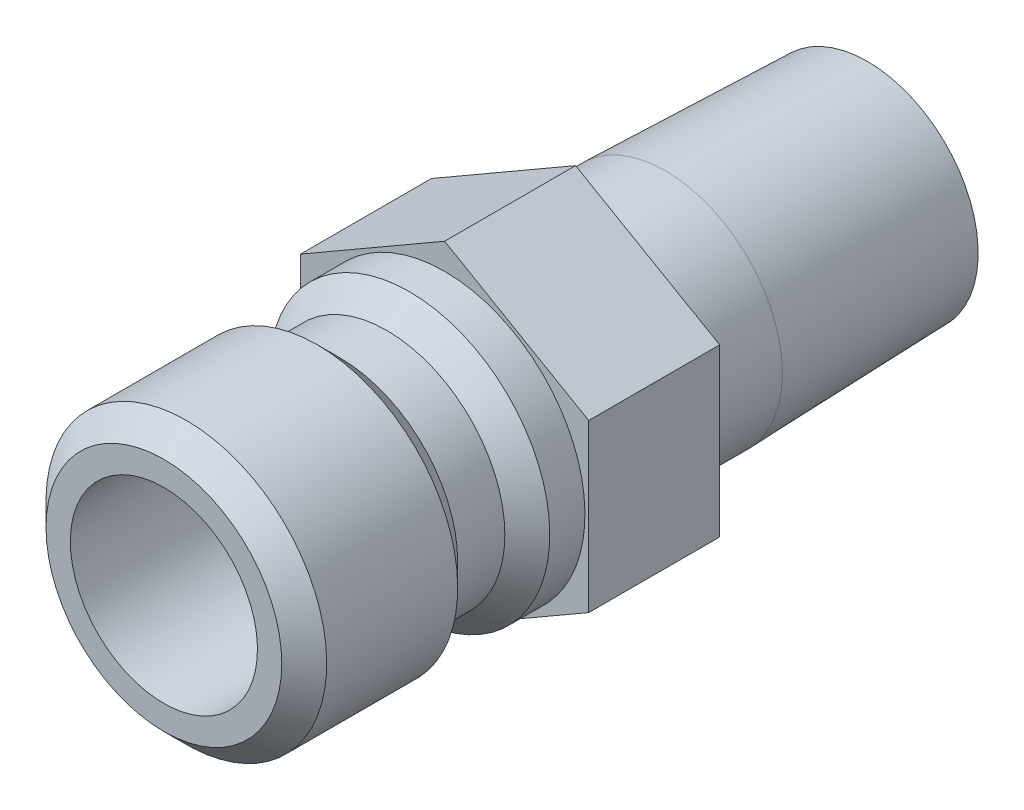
ISO-10303-21;
HEADER;
FILE_DESCRIPTION(('STEP AP214'),'2;1');
FILE_NAME('part.step','',(''),(''),'','','');
FILE_SCHEMA(('AUTOMOTIVE_DESIGN { 1 0 10303 214 1 1 1 1 }'));
ENDSEC;
DATA;
#1=APPLICATION_CONTEXT('core data for automotive mechanical design processes');
#2=APPLICATION_PROTOCOL_DEFINITION('international standard','automotive_design',2000,#1);
#3=PRODUCT_CONTEXT('',#1,'mechanical');
#4=PRODUCT('Part','Part','',(#3));
#5=PRODUCT_RELATED_PRODUCT_CATEGORY('part','',(#4));
#6=PRODUCT_DEFINITION_FORMATION('','',#4);
#7=PRODUCT_DEFINITION_CONTEXT('part definition',#1,'design');
#8=PRODUCT_DEFINITION('design','',#6,#7);
#9=PRODUCT_DEFINITION_SHAPE('','',#8);
#10=(LENGTH_UNIT() NAMED_UNIT(*) SI_UNIT(.MILLI.,.METRE.));
#11=(NAMED_UNIT(*) PLANE_ANGLE_UNIT() SI_UNIT($,.RADIAN.));
#12=(NAMED_UNIT(*) SI_UNIT($,.STERADIAN.) SOLID_ANGLE_UNIT());
#13=UNCERTAINTY_MEASURE_WITH_UNIT(LENGTH_MEASURE(1.E-05),#10,'distance_accuracy_value','');
#14=(GEOMETRIC_REPRESENTATION_CONTEXT(3) GLOBAL_UNCERTAINTY_ASSIGNED_CONTEXT((#13)) GLOBAL_UNIT_ASSIGNED_CONTEXT((#10,
#11,#12)) REPRESENTATION_CONTEXT('',''));
#15=CARTESIAN_POINT('',(0.,0.,0.));
#16=DIRECTION('',(0.,0.,1.));
#17=DIRECTION('',(1.,0.,0.));
#18=AXIS2_PLACEMENT_3D('',#15,#16,#17);
#19=CARTESIAN_POINT('',(0.,0.,0.));
#20=DIRECTION('',(0.,0.,-1.));
#21=DIRECTION('',(0.,1.,0.));
#22=AXIS2_PLACEMENT_3D('',#19,#20,#21);
#23=CYLINDRICAL_SURFACE('',#22,3.96875);
#24=CARTESIAN_POINT('',(0.,0.,-7.493));
#25=DIRECTION('',(0.,0.,-1.));
#26=DIRECTION('',(0.,1.,0.));
#27=AXIS2_PLACEMENT_3D('',#24,#25,#26);
#28=CIRCLE('',#27,3.96875);
#29=CARTESIAN_POINT('',(0.,3.96875,-7.493));
#30=VERTEX_POINT('',#29);
#31=EDGE_CURVE('E155',#30,#30,#28,.T.);
#32=ORIENTED_EDGE('',*,*,#31,.F.);
#33=EDGE_LOOP('',(#32));
#34=FACE_BOUND('',#33,.T.);
#35=CARTESIAN_POINT('',(0.,0.,-4.445));
#36=DIRECTION('',(0.,0.,1.));
#37=DIRECTION('',(1.,0.,0.));
#38=AXIS2_PLACEMENT_3D('',#35,#36,#37);
#39=CIRCLE('',#38,3.96875);
#40=CARTESIAN_POINT('',(3.96875,0.,-4.445));
#41=VERTEX_POINT('',#40);
#42=EDGE_CURVE('E36',#41,#41,#39,.F.);
#43=ORIENTED_EDGE('',*,*,#42,.T.);
#44=EDGE_LOOP('',(#43));
#45=FACE_BOUND('',#44,.T.);
#46=ADVANCED_FACE('F32',(#34,#45),#23,.T.);
#47=CARTESIAN_POINT('',(0.,0.,0.));
#48=DIRECTION('',(0.,0.,-1.));
#49=DIRECTION('',(0.,1.,0.));
#50=AXIS2_PLACEMENT_3D('',#47,#48,#49);
#51=CYLINDRICAL_SURFACE('',#50,3.175);
#52=CARTESIAN_POINT('',(0.,0.,9.525));
#53=DIRECTION('',(0.,0.,-1.));
#54=DIRECTION('',(0.,1.,0.));
#55=AXIS2_PLACEMENT_3D('',#52,#53,#54);
#56=CIRCLE('',#55,3.175);
#57=CARTESIAN_POINT('',(0.,3.175,9.525));
#58=VERTEX_POINT('',#57);
#59=EDGE_CURVE('E11',#58,#58,#56,.T.);
#60=ORIENTED_EDGE('',*,*,#59,.F.);
#61=EDGE_LOOP('',(#60));
#62=FACE_BOUND('',#61,.T.);
#63=CARTESIAN_POINT('',(0.,0.,-0.126999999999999));
#64=DIRECTION('',(0.,0.,-1.));
#65=DIRECTION('',(0.,1.,0.));
#66=AXIS2_PLACEMENT_3D('',#63,#64,#65);
#67=CIRCLE('',#66,3.175);
#68=CARTESIAN_POINT('',(0.,3.175,-0.126999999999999));
#69=VERTEX_POINT('',#68);
#70=EDGE_CURVE('E143',#69,#69,#67,.T.);
#71=ORIENTED_EDGE('',*,*,#70,.T.);
#72=EDGE_LOOP('',(#71));
#73=FACE_BOUND('',#72,.T.);
#74=ADVANCED_FACE('F34',(#62,#73),#51,.F.);
#75=CARTESIAN_POINT('',(0.,3.175,9.525));
#76=DIRECTION('',(0.,0.,1.));
#77=DIRECTION('',(0.,-1.,0.));
#78=AXIS2_PLACEMENT_3D('',#75,#76,#77);
#79=PLANE('',#78);
#80=ORIENTED_EDGE('',*,*,#59,.T.);
#81=EDGE_LOOP('',(#80));
#82=FACE_BOUND('',#81,.T.);
#83=CARTESIAN_POINT('',(0.,0.,9.525));
#84=DIRECTION('',(0.,0.,-1.));
#85=DIRECTION('',(0.,1.,0.));
#86=AXIS2_PLACEMENT_3D('',#83,#84,#85);
#87=CIRCLE('',#86,4.0005);
#88=CARTESIAN_POINT('',(0.,4.0005,9.525));
#89=VERTEX_POINT('',#88);
#90=EDGE_CURVE('E42',#89,#89,#87,.T.);
#91=ORIENTED_EDGE('',*,*,#90,.F.);
#92=EDGE_LOOP('',(#91));
#93=FACE_BOUND('',#92,.T.);
#94=ADVANCED_FACE('F182',(#82,#93),#79,.T.);
#95=CARTESIAN_POINT('',(0.,0.,8.763));
#96=DIRECTION('',(0.,0.,-1.));
#97=DIRECTION('',(0.,1.,0.));
#98=AXIS2_PLACEMENT_3D('',#95,#96,#97);
#99=CONICAL_SURFACE('',#98,4.7625,0.785398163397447);
#100=ORIENTED_EDGE('',*,*,#90,.T.);
#101=EDGE_LOOP('',(#100));
#102=FACE_BOUND('',#101,.T.);
#103=CARTESIAN_POINT('',(0.,0.,8.763));
#104=DIRECTION('',(0.,0.,-1.));
#105=DIRECTION('',(0.,1.,0.));
#106=AXIS2_PLACEMENT_3D('',#103,#104,#105);
#107=CIRCLE('',#106,4.7625);
#108=CARTESIAN_POINT('',(0.,4.7625,8.763));
#109=VERTEX_POINT('',#108);
#110=EDGE_CURVE('E173',#109,#109,#107,.T.);
#111=ORIENTED_EDGE('',*,*,#110,.F.);
#112=EDGE_LOOP('',(#111));
#113=FACE_BOUND('',#112,.T.);
#114=ADVANCED_FACE('F179',(#102,#113),#99,.T.);
#115=CARTESIAN_POINT('',(0.,0.,0.));
#116=DIRECTION('',(0.,0.,-1.));
#117=DIRECTION('',(0.,1.,0.));
#118=AXIS2_PLACEMENT_3D('',#115,#116,#117);
#119=CYLINDRICAL_SURFACE('',#118,4.7625);
#120=ORIENTED_EDGE('',*,*,#110,.T.);
#121=EDGE_LOOP('',(#120));
#122=FACE_BOUND('',#121,.T.);
#123=CARTESIAN_POINT('',(0.,0.,4.318));
#124=DIRECTION('',(0.,0.,-1.));
#125=DIRECTION('',(0.,1.,0.));
#126=AXIS2_PLACEMENT_3D('',#123,#124,#125);
#127=CIRCLE('',#126,4.7625);
#128=CARTESIAN_POINT('',(0.,4.7625,4.318));
#129=VERTEX_POINT('',#128);
#130=EDGE_CURVE('E170',#129,#129,#127,.T.);
#131=ORIENTED_EDGE('',*,*,#130,.F.);
#132=EDGE_LOOP('',(#131));
#133=FACE_BOUND('',#132,.T.);
#134=ADVANCED_FACE('F189',(#122,#133),#119,.T.);
#135=CARTESIAN_POINT('',(0.,0.,3.556));
#136=DIRECTION('',(0.,0.,1.));
#137=DIRECTION('',(0.,-1.,0.));
#138=AXIS2_PLACEMENT_3D('',#135,#136,#137);
#139=CONICAL_SURFACE('',#138,4.0005,0.785398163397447);
#140=ORIENTED_EDGE('',*,*,#130,.T.);
#141=EDGE_LOOP('',(#140));
#142=FACE_BOUND('',#141,.T.);
#143=CARTESIAN_POINT('',(0.,0.,3.556));
#144=DIRECTION('',(0.,0.,-1.));
#145=DIRECTION('',(0.,1.,0.));
#146=AXIS2_PLACEMENT_3D('',#143,#144,#145);
#147=CIRCLE('',#146,4.0005);
#148=CARTESIAN_POINT('',(0.,4.0005,3.556));
#149=VERTEX_POINT('',#148);
#150=EDGE_CURVE('E167',#149,#149,#147,.T.);
#151=ORIENTED_EDGE('',*,*,#150,.F.);
#152=EDGE_LOOP('',(#151));
#153=FACE_BOUND('',#152,.T.);
#154=ADVANCED_FACE('F214',(#142,#153),#139,.T.);
#155=CARTESIAN_POINT('',(0.,0.,0.));
#156=DIRECTION('',(0.,0.,-1.));
#157=DIRECTION('',(0.,1.,0.));
#158=AXIS2_PLACEMENT_3D('',#155,#156,#157);
#159=CYLINDRICAL_SURFACE('',#158,4.0005);
#160=ORIENTED_EDGE('',*,*,#150,.T.);
#161=EDGE_LOOP('',(#160));
#162=FACE_BOUND('',#161,.T.);
#163=CARTESIAN_POINT('',(0.,0.,1.9558));
#164=DIRECTION('',(0.,0.,-1.));
#165=DIRECTION('',(0.,1.,0.));
#166=AXIS2_PLACEMENT_3D('',#163,#164,#165);
#167=CIRCLE('',#166,4.0005);
#168=CARTESIAN_POINT('',(0.,4.0005,1.9558));
#169=VERTEX_POINT('',#168);
#170=EDGE_CURVE('E164',#169,#169,#167,.T.);
#171=ORIENTED_EDGE('',*,*,#170,.F.);
#172=EDGE_LOOP('',(#171));
#173=FACE_BOUND('',#172,.T.);
#174=ADVANCED_FACE('F210',(#162,#173),#159,.T.);
#175=CARTESIAN_POINT('',(0.,0.,1.1938));
#176=DIRECTION('',(0.,0.,-1.));
#177=DIRECTION('',(0.,1.,0.));
#178=AXIS2_PLACEMENT_3D('',#175,#176,#177);
#179=CONICAL_SURFACE('',#178,4.7625,0.785398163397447);
#180=ORIENTED_EDGE('',*,*,#170,.T.);
#181=EDGE_LOOP('',(#180));
#182=FACE_BOUND('',#181,.T.);
#183=CARTESIAN_POINT('',(0.,0.,1.1938));
#184=DIRECTION('',(0.,0.,-1.));
#185=DIRECTION('',(0.,1.,0.));
#186=AXIS2_PLACEMENT_3D('',#183,#184,#185);
#187=CIRCLE('',#186,4.7625);
#188=CARTESIAN_POINT('',(0.,4.7625,1.1938));
#189=VERTEX_POINT('',#188);
#190=EDGE_CURVE('E161',#189,#189,#187,.T.);
#191=ORIENTED_EDGE('',*,*,#190,.F.);
#192=EDGE_LOOP('',(#191));
#193=FACE_BOUND('',#192,.T.);
#194=ADVANCED_FACE('F206',(#182,#193),#179,.T.);
#195=CARTESIAN_POINT('',(0.,0.,0.));
#196=DIRECTION('',(0.,0.,-1.));
#197=DIRECTION('',(0.,1.,0.));
#198=AXIS2_PLACEMENT_3D('',#195,#196,#197);
#199=CYLINDRICAL_SURFACE('',#198,4.7625);
#200=ORIENTED_EDGE('',*,*,#190,.T.);
#201=EDGE_LOOP('',(#200));
#202=FACE_BOUND('',#201,.T.);
#203=CARTESIAN_POINT('',(0.,0.,0.));
#204=DIRECTION('',(0.,0.,-1.));
#205=DIRECTION('',(0.,1.,0.));
#206=AXIS2_PLACEMENT_3D('',#203,#204,#205);
#207=CIRCLE('',#206,4.7625);
#208=CARTESIAN_POINT('',(0.,4.7625,0.));
#209=VERTEX_POINT('',#208);
#210=EDGE_CURVE('E158',#209,#209,#207,.T.);
#211=ORIENTED_EDGE('',*,*,#210,.F.);
#212=EDGE_LOOP('',(#211));
#213=FACE_BOUND('',#212,.T.);
#214=ADVANCED_FACE('F203',(#202,#213),#199,.T.);
#215=CARTESIAN_POINT('',(0.,0.,-14.351));
#216=DIRECTION('',(0.,0.,1.));
#217=DIRECTION('',(0.,-1.,0.));
#218=AXIS2_PLACEMENT_3D('',#215,#216,#217);
#219=CONICAL_SURFACE('',#218,3.7544387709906,0.0312396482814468);
#220=ORIENTED_EDGE('',*,*,#31,.T.);
#221=EDGE_LOOP('',(#220));
#222=FACE_BOUND('',#221,.T.);
#223=CARTESIAN_POINT('',(0.,0.,-14.351));
#224=DIRECTION('',(0.,0.,-1.));
#225=DIRECTION('',(0.,1.,0.));
#226=AXIS2_PLACEMENT_3D('',#223,#224,#225);
#227=CIRCLE('',#226,3.7544387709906);
#228=CARTESIAN_POINT('',(0.,3.7544387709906,-14.351));
#229=VERTEX_POINT('',#228);
#230=EDGE_CURVE('E152',#229,#229,#227,.T.);
#231=ORIENTED_EDGE('',*,*,#230,.F.);
#232=EDGE_LOOP('',(#231));
#233=FACE_BOUND('',#232,.T.);
#234=ADVANCED_FACE('F201',(#222,#233),#219,.T.);
#235=CARTESIAN_POINT('',(0.,3.7544387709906,-14.351));
#236=DIRECTION('',(0.,0.,-1.));
#237=DIRECTION('',(0.,1.,0.));
#238=AXIS2_PLACEMENT_3D('',#235,#236,#237);
#239=PLANE('',#238);
#240=ORIENTED_EDGE('',*,*,#230,.T.);
#241=EDGE_LOOP('',(#240));
#242=FACE_BOUND('',#241,.T.);
#243=CARTESIAN_POINT('',(0.,0.,-14.351));
#244=DIRECTION('',(0.,0.,-1.));
#245=DIRECTION('',(0.,1.,0.));
#246=AXIS2_PLACEMENT_3D('',#243,#244,#245);
#247=CIRCLE('',#246,2.38125);
#248=CARTESIAN_POINT('',(0.,2.38125,-14.351));
#249=VERTEX_POINT('',#248);
#250=EDGE_CURVE('E149',#249,#249,#247,.T.);
#251=ORIENTED_EDGE('',*,*,#250,.F.);
#252=EDGE_LOOP('',(#251));
#253=FACE_BOUND('',#252,.T.);
#254=ADVANCED_FACE('F267',(#242,#253),#239,.T.);
#255=CARTESIAN_POINT('',(0.,0.,0.));
#256=DIRECTION('',(0.,0.,-1.));
#257=DIRECTION('',(0.,1.,0.));
#258=AXIS2_PLACEMENT_3D('',#255,#256,#257);
#259=CYLINDRICAL_SURFACE('',#258,2.38125);
#260=ORIENTED_EDGE('',*,*,#250,.T.);
#261=EDGE_LOOP('',(#260));
#262=FACE_BOUND('',#261,.T.);
#263=CARTESIAN_POINT('',(0.,0.,-0.126999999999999));
#264=DIRECTION('',(0.,0.,-1.));
#265=DIRECTION('',(0.,1.,0.));
#266=AXIS2_PLACEMENT_3D('',#263,#264,#265);
#267=CIRCLE('',#266,2.38125);
#268=CARTESIAN_POINT('',(0.,2.38125,-0.126999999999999));
#269=VERTEX_POINT('',#268);
#270=EDGE_CURVE('E146',#269,#269,#267,.T.);
#271=ORIENTED_EDGE('',*,*,#270,.F.);
#272=EDGE_LOOP('',(#271));
#273=FACE_BOUND('',#272,.T.);
#274=ADVANCED_FACE('F264',(#262,#273),#259,.F.);
#275=CARTESIAN_POINT('',(0.,3.175,-0.126999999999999));
#276=DIRECTION('',(0.,0.,1.));
#277=DIRECTION('',(0.,-1.,0.));
#278=AXIS2_PLACEMENT_3D('',#275,#276,#277);
#279=PLANE('',#278);
#280=ORIENTED_EDGE('',*,*,#270,.T.);
#281=EDGE_LOOP('',(#280));
#282=FACE_BOUND('',#281,.T.);
#283=ORIENTED_EDGE('',*,*,#70,.F.);
#284=EDGE_LOOP('',(#283));
#285=FACE_BOUND('',#284,.T.);
#286=ADVANCED_FACE('F252',(#282,#285),#279,.T.);
#287=CARTESIAN_POINT('',(0.,5.64590828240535,-4.445));
#288=DIRECTION('',(-0.5,0.866025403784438,0.));
#289=DIRECTION('',(-0.866025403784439,-0.5,0.));
#290=AXIS2_PLACEMENT_3D('',#287,#288,#289);
#291=PLANE('',#290);
#292=DIRECTION('',(-0.866025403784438,-0.5,0.));
#293=VECTOR('',#292,1.);
#294=CARTESIAN_POINT('',(0.,5.64590828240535,0.));
#295=LINE('',#294,#293);
#296=CARTESIAN_POINT('',(0.,5.64590828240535,0.));
#297=VERTEX_POINT('',#296);
#298=CARTESIAN_POINT('',(-4.8895,2.82295414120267,0.));
#299=VERTEX_POINT('',#298);
#300=EDGE_CURVE('E121',#297,#299,#295,.T.);
#301=ORIENTED_EDGE('',*,*,#300,.F.);
#302=DIRECTION('',(0.,0.,1.));
#303=VECTOR('',#302,1.);
#304=CARTESIAN_POINT('',(0.,5.64590828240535,-4.445));
#305=LINE('',#304,#303);
#306=CARTESIAN_POINT('',(0.,5.64590828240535,-4.445));
#307=VERTEX_POINT('',#306);
#308=EDGE_CURVE('E50',#307,#297,#305,.T.);
#309=ORIENTED_EDGE('',*,*,#308,.F.);
#310=DIRECTION('',(-0.866025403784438,-0.5,0.));
#311=VECTOR('',#310,1.);
#312=CARTESIAN_POINT('',(0.,5.64590828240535,-4.445));
#313=LINE('',#312,#311);
#314=CARTESIAN_POINT('',(-4.8895,2.82295414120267,-4.445));
#315=VERTEX_POINT('',#314);
#316=EDGE_CURVE('E136',#307,#315,#313,.T.);
#317=ORIENTED_EDGE('',*,*,#316,.T.);
#318=DIRECTION('',(0.,0.,1.));
#319=VECTOR('',#318,1.);
#320=CARTESIAN_POINT('',(-4.8895,2.82295414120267,-4.445));
#321=LINE('',#320,#319);
#322=EDGE_CURVE('E85',#315,#299,#321,.T.);
#323=ORIENTED_EDGE('',*,*,#322,.T.);
#324=EDGE_LOOP('',(#301,#309,#317,#323));
#325=FACE_BOUND('',#324,.T.);
#326=ADVANCED_FACE('F239',(#325),#291,.T.);
#327=CARTESIAN_POINT('',(4.8895,2.82295414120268,-4.445));
#328=DIRECTION('',(0.5,0.866025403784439,0.));
#329=DIRECTION('',(-0.866025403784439,0.5,0.));
#330=AXIS2_PLACEMENT_3D('',#327,#328,#329);
#331=PLANE('',#330);
#332=DIRECTION('',(-0.866025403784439,0.5,0.));
#333=VECTOR('',#332,1.);
#334=CARTESIAN_POINT('',(4.8895,2.82295414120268,0.));
#335=LINE('',#334,#333);
#336=CARTESIAN_POINT('',(4.8895,2.82295414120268,0.));
#337=VERTEX_POINT('',#336);
#338=EDGE_CURVE('E133',#337,#297,#335,.T.);
#339=ORIENTED_EDGE('',*,*,#338,.F.);
#340=DIRECTION('',(0.,0.,1.));
#341=VECTOR('',#340,1.);
#342=CARTESIAN_POINT('',(4.8895,2.82295414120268,-4.445));
#343=LINE('',#342,#341);
#344=CARTESIAN_POINT('',(4.8895,2.82295414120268,-4.445));
#345=VERTEX_POINT('',#344);
#346=EDGE_CURVE('E73',#345,#337,#343,.T.);
#347=ORIENTED_EDGE('',*,*,#346,.F.);
#348=DIRECTION('',(-0.866025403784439,0.5,0.));
#349=VECTOR('',#348,1.);
#350=CARTESIAN_POINT('',(4.8895,2.82295414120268,-4.445));
#351=LINE('',#350,#349);
#352=EDGE_CURVE('E111',#345,#307,#351,.T.);
#353=ORIENTED_EDGE('',*,*,#352,.T.);
#354=ORIENTED_EDGE('',*,*,#308,.T.);
#355=EDGE_LOOP('',(#339,#347,#353,#354));
#356=FACE_BOUND('',#355,.T.);
#357=ADVANCED_FACE('F244',(#356),#331,.T.);
#358=CARTESIAN_POINT('',(4.8895,-2.82295414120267,-4.445));
#359=DIRECTION('',(1.,0.,0.));
#360=DIRECTION('',(0.,0.,-1.));
#361=AXIS2_PLACEMENT_3D('',#358,#359,#360);
#362=PLANE('',#361);
#363=DIRECTION('',(0.,1.,0.));
#364=VECTOR('',#363,1.);
#365=CARTESIAN_POINT('',(4.8895,-2.82295414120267,0.));
#366=LINE('',#365,#364);
#367=CARTESIAN_POINT('',(4.8895,-2.82295414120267,0.));
#368=VERTEX_POINT('',#367);
#369=EDGE_CURVE('E98',#368,#337,#366,.T.);
#370=ORIENTED_EDGE('',*,*,#369,.F.);
#371=DIRECTION('',(0.,0.,1.));
#372=VECTOR('',#371,1.);
#373=CARTESIAN_POINT('',(4.8895,-2.82295414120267,-4.445));
#374=LINE('',#373,#372);
#375=CARTESIAN_POINT('',(4.8895,-2.82295414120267,-4.445));
#376=VERTEX_POINT('',#375);
#377=EDGE_CURVE('E93',#376,#368,#374,.T.);
#378=ORIENTED_EDGE('',*,*,#377,.F.);
#379=DIRECTION('',(0.,1.,0.));
#380=VECTOR('',#379,1.);
#381=CARTESIAN_POINT('',(4.8895,-2.82295414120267,-4.445));
#382=LINE('',#381,#380);
#383=EDGE_CURVE('E96',#376,#345,#382,.T.);
#384=ORIENTED_EDGE('',*,*,#383,.T.);
#385=ORIENTED_EDGE('',*,*,#346,.T.);
#386=EDGE_LOOP('',(#370,#378,#384,#385));
#387=FACE_BOUND('',#386,.T.);
#388=ADVANCED_FACE('F95',(#387),#362,.T.);
#389=CARTESIAN_POINT('',(0.,-5.64590828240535,-4.445));
#390=DIRECTION('',(0.5,-0.866025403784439,0.));
#391=DIRECTION('',(0.866025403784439,0.5,0.));
#392=AXIS2_PLACEMENT_3D('',#389,#390,#391);
#393=PLANE('',#392);
#394=DIRECTION('',(0.866025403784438,0.5,0.));
#395=VECTOR('',#394,1.);
#396=CARTESIAN_POINT('',(0.,-5.64590828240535,0.));
#397=LINE('',#396,#395);
#398=CARTESIAN_POINT('',(0.,-5.64590828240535,0.));
#399=VERTEX_POINT('',#398);
#400=EDGE_CURVE('E130',#399,#368,#397,.T.);
#401=ORIENTED_EDGE('',*,*,#400,.F.);
#402=DIRECTION('',(0.,0.,1.));
#403=VECTOR('',#402,1.);
#404=CARTESIAN_POINT('',(0.,-5.64590828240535,-4.445));
#405=LINE('',#404,#403);
#406=CARTESIAN_POINT('',(0.,-5.64590828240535,-4.445));
#407=VERTEX_POINT('',#406);
#408=EDGE_CURVE('E103',#407,#399,#405,.T.);
#409=ORIENTED_EDGE('',*,*,#408,.F.);
#410=DIRECTION('',(0.866025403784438,0.5,0.));
#411=VECTOR('',#410,1.);
#412=CARTESIAN_POINT('',(0.,-5.64590828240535,-4.445));
#413=LINE('',#412,#411);
#414=EDGE_CURVE('E109',#407,#376,#413,.T.);
#415=ORIENTED_EDGE('',*,*,#414,.T.);
#416=ORIENTED_EDGE('',*,*,#377,.T.);
#417=EDGE_LOOP('',(#401,#409,#415,#416));
#418=FACE_BOUND('',#417,.T.);
#419=ADVANCED_FACE('F113',(#418),#393,.T.);
#420=CARTESIAN_POINT('',(-4.8895,-2.82295414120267,-4.445));
#421=DIRECTION('',(-0.5,-0.866025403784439,0.));
#422=DIRECTION('',(0.866025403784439,-0.5,0.));
#423=AXIS2_PLACEMENT_3D('',#420,#421,#422);
#424=PLANE('',#423);
#425=DIRECTION('',(0.866025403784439,-0.5,0.));
#426=VECTOR('',#425,1.);
#427=CARTESIAN_POINT('',(-4.8895,-2.82295414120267,0.));
#428=LINE('',#427,#426);
#429=CARTESIAN_POINT('',(-4.8895,-2.82295414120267,0.));
#430=VERTEX_POINT('',#429);
#431=EDGE_CURVE('E127',#430,#399,#428,.T.);
#432=ORIENTED_EDGE('',*,*,#431,.F.);
#433=DIRECTION('',(0.,0.,1.));
#434=VECTOR('',#433,1.);
#435=CARTESIAN_POINT('',(-4.8895,-2.82295414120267,-4.445));
#436=LINE('',#435,#434);
#437=CARTESIAN_POINT('',(-4.8895,-2.82295414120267,-4.445));
#438=VERTEX_POINT('',#437);
#439=EDGE_CURVE('E140',#438,#430,#436,.T.);
#440=ORIENTED_EDGE('',*,*,#439,.F.);
#441=DIRECTION('',(0.866025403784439,-0.5,0.));
#442=VECTOR('',#441,1.);
#443=CARTESIAN_POINT('',(-4.8895,-2.82295414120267,-4.445));
#444=LINE('',#443,#442);
#445=EDGE_CURVE('E114',#438,#407,#444,.T.);
#446=ORIENTED_EDGE('',*,*,#445,.T.);
#447=ORIENTED_EDGE('',*,*,#408,.T.);
#448=EDGE_LOOP('',(#432,#440,#446,#447));
#449=FACE_BOUND('',#448,.T.);
#450=ADVANCED_FACE('F243',(#449),#424,.T.);
#451=CARTESIAN_POINT('',(-4.8895,2.82295414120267,-4.445));
#452=DIRECTION('',(-1.,0.,0.));
#453=DIRECTION('',(0.,0.,1.));
#454=AXIS2_PLACEMENT_3D('',#451,#452,#453);
#455=PLANE('',#454);
#456=DIRECTION('',(0.,-1.,0.));
#457=VECTOR('',#456,1.);
#458=CARTESIAN_POINT('',(-4.8895,2.82295414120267,0.));
#459=LINE('',#458,#457);
#460=EDGE_CURVE('E124',#299,#430,#459,.T.);
#461=ORIENTED_EDGE('',*,*,#460,.F.);
#462=ORIENTED_EDGE('',*,*,#322,.F.);
#463=DIRECTION('',(0.,-1.,0.));
#464=VECTOR('',#463,1.);
#465=CARTESIAN_POINT('',(-4.8895,2.82295414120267,-4.445));
#466=LINE('',#465,#464);
#467=EDGE_CURVE('E116',#315,#438,#466,.T.);
#468=ORIENTED_EDGE('',*,*,#467,.T.);
#469=ORIENTED_EDGE('',*,*,#439,.T.);
#470=EDGE_LOOP('',(#461,#462,#468,#469));
#471=FACE_BOUND('',#470,.T.);
#472=ADVANCED_FACE('F240',(#471),#455,.T.);
#473=CARTESIAN_POINT('',(-4.8895,2.82295414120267,-4.445));
#474=DIRECTION('',(0.,0.,1.));
#475=DIRECTION('',(1.,0.,0.));
#476=AXIS2_PLACEMENT_3D('',#473,#474,#475);
#477=PLANE('',#476);
#478=ORIENTED_EDGE('',*,*,#42,.F.);
#479=EDGE_LOOP('',(#478));
#480=FACE_BOUND('',#479,.T.);
#481=ORIENTED_EDGE('',*,*,#316,.F.);
#482=ORIENTED_EDGE('',*,*,#352,.F.);
#483=ORIENTED_EDGE('',*,*,#383,.F.);
#484=ORIENTED_EDGE('',*,*,#414,.F.);
#485=ORIENTED_EDGE('',*,*,#445,.F.);
#486=ORIENTED_EDGE('',*,*,#467,.F.);
#487=EDGE_LOOP('',(#481,#482,#483,#484,#485,#486));
#488=FACE_BOUND('',#487,.T.);
#489=ADVANCED_FACE('F107',(#480,#488),#477,.F.);
#490=CARTESIAN_POINT('',(-4.8895,2.82295414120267,0.));
#491=DIRECTION('',(0.,0.,1.));
#492=DIRECTION('',(1.,0.,0.));
#493=AXIS2_PLACEMENT_3D('',#490,#491,#492);
#494=PLANE('',#493);
#495=ORIENTED_EDGE('',*,*,#210,.T.);
#496=EDGE_LOOP('',(#495));
#497=FACE_BOUND('',#496,.T.);
#498=ORIENTED_EDGE('',*,*,#300,.T.);
#499=ORIENTED_EDGE('',*,*,#460,.T.);
#500=ORIENTED_EDGE('',*,*,#431,.T.);
#501=ORIENTED_EDGE('',*,*,#400,.T.);
#502=ORIENTED_EDGE('',*,*,#369,.T.);
#503=ORIENTED_EDGE('',*,*,#338,.T.);
#504=EDGE_LOOP('',(#498,#499,#500,#501,#502,#503));
#505=FACE_BOUND('',#504,.T.);
#506=ADVANCED_FACE('F235',(#497,#505),#494,.T.);
#507=CLOSED_SHELL('',(#46,#74,#94,#114,#134,#154,#174,#194,#214,#234,#254,#274,#286,#326,#357,
#388,#419,#450,#472,#489,#506));
#508=MANIFOLD_SOLID_BREP('B2',#507);
#509=ADVANCED_BREP_SHAPE_REPRESENTATION('',(#18,#508),#14);
#510=SHAPE_DEFINITION_REPRESENTATION(#9,#509);
ENDSEC;
END-ISO-10303-21;
